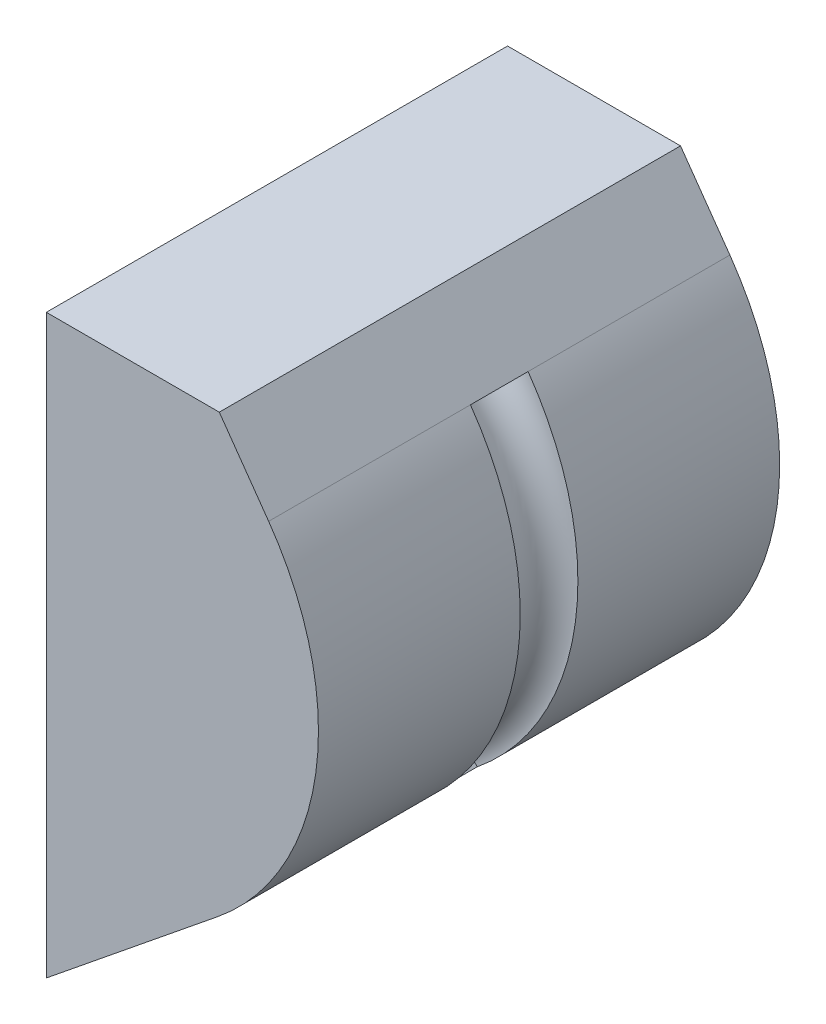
ISO-10303-21;
HEADER;
FILE_DESCRIPTION(('STEP AP214'),'2;1');
FILE_NAME('part.step','',(''),(''),'','','');
FILE_SCHEMA(('AUTOMOTIVE_DESIGN { 1 0 10303 214 1 1 1 1 }'));
ENDSEC;
DATA;
#1=APPLICATION_CONTEXT('core data for automotive mechanical design processes');
#2=APPLICATION_PROTOCOL_DEFINITION('international standard','automotive_design',2000,#1);
#3=PRODUCT_CONTEXT('',#1,'mechanical');
#4=PRODUCT('Part','Part','',(#3));
#5=PRODUCT_RELATED_PRODUCT_CATEGORY('part','',(#4));
#6=PRODUCT_DEFINITION_FORMATION('','',#4);
#7=PRODUCT_DEFINITION_CONTEXT('part definition',#1,'design');
#8=PRODUCT_DEFINITION('design','',#6,#7);
#9=PRODUCT_DEFINITION_SHAPE('','',#8);
#10=(LENGTH_UNIT() NAMED_UNIT(*) SI_UNIT(.MILLI.,.METRE.));
#11=(NAMED_UNIT(*) PLANE_ANGLE_UNIT() SI_UNIT($,.RADIAN.));
#12=(NAMED_UNIT(*) SI_UNIT($,.STERADIAN.) SOLID_ANGLE_UNIT());
#13=UNCERTAINTY_MEASURE_WITH_UNIT(LENGTH_MEASURE(1.E-05),#10,'distance_accuracy_value','');
#14=(GEOMETRIC_REPRESENTATION_CONTEXT(3) GLOBAL_UNCERTAINTY_ASSIGNED_CONTEXT((#13)) GLOBAL_UNIT_ASSIGNED_CONTEXT((#10,
#11,#12)) REPRESENTATION_CONTEXT('',''));
#15=CARTESIAN_POINT('',(0.,0.,0.));
#16=DIRECTION('',(0.,0.,1.));
#17=DIRECTION('',(1.,0.,0.));
#18=AXIS2_PLACEMENT_3D('',#15,#16,#17);
#19=CARTESIAN_POINT('',(0.0911484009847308,-39.3044537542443,40.));
#20=DIRECTION('',(0.,0.,-1.));
#21=DIRECTION('',(-1.,0.,0.));
#22=AXIS2_PLACEMENT_3D('',#19,#20,#21);
#23=CYLINDRICAL_SURFACE('',#22,47.1085503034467);
#24=DIRECTION('',(0.,0.,-1.));
#25=VECTOR('',#24,1.);
#26=CARTESIAN_POINT('',(29.7407595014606,-75.9120495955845,40.));
#27=LINE('',#26,#25);
#28=CARTESIAN_POINT('',(29.7407595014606,-75.9120495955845,40.));
#29=VERTEX_POINT('',#28);
#30=CARTESIAN_POINT('',(29.7407595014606,-75.9120495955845,5.));
#31=VERTEX_POINT('',#30);
#32=EDGE_CURVE('E41',#29,#31,#27,.T.);
#33=ORIENTED_EDGE('',*,*,#32,.T.);
#34=CARTESIAN_POINT('',(0.0911484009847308,-39.3044537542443,5.));
#35=DIRECTION('',(0.,0.,-1.));
#36=DIRECTION('',(-1.,0.,0.));
#37=AXIS2_PLACEMENT_3D('',#34,#35,#36);
#38=CIRCLE('',#37,47.1085503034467);
#39=CARTESIAN_POINT('',(38.5631158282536,-12.1176327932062,5.));
#40=VERTEX_POINT('',#39);
#41=EDGE_CURVE('E102',#31,#40,#38,.F.);
#42=ORIENTED_EDGE('',*,*,#41,.T.);
#43=DIRECTION('',(0.,0.,-1.));
#44=VECTOR('',#43,1.);
#45=CARTESIAN_POINT('',(38.5631158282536,-12.1176327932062,40.));
#46=LINE('',#45,#44);
#47=CARTESIAN_POINT('',(38.5631158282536,-12.1176327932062,40.));
#48=VERTEX_POINT('',#47);
#49=EDGE_CURVE('E95',#48,#40,#46,.T.);
#50=ORIENTED_EDGE('',*,*,#49,.F.);
#51=CARTESIAN_POINT('',(0.0911484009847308,-39.3044537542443,40.));
#52=DIRECTION('',(0.,0.,1.));
#53=DIRECTION('',(-1.,0.,0.));
#54=AXIS2_PLACEMENT_3D('',#51,#52,#53);
#55=CIRCLE('',#54,47.1085503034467);
#56=EDGE_CURVE('E134',#29,#48,#55,.T.);
#57=ORIENTED_EDGE('',*,*,#56,.F.);
#58=EDGE_LOOP('',(#33,#42,#50,#57));
#59=FACE_BOUND('',#58,.T.);
#60=ADVANCED_FACE('F33',(#59),#23,.T.);
#61=CARTESIAN_POINT('',(0.,0.,40.));
#62=DIRECTION('',(1.,0.,0.));
#63=DIRECTION('',(0.,1.,0.));
#64=AXIS2_PLACEMENT_3D('',#61,#62,#63);
#65=PLANE('',#64);
#66=DIRECTION('',(0.,-1.,0.));
#67=VECTOR('',#66,1.);
#68=CARTESIAN_POINT('',(0.,0.,-40.));
#69=LINE('',#68,#67);
#70=CARTESIAN_POINT('',(0.,0.,-40.));
#71=VERTEX_POINT('',#70);
#72=CARTESIAN_POINT('',(0.,-100.,-40.));
#73=VERTEX_POINT('',#72);
#74=EDGE_CURVE('E115',#71,#73,#69,.T.);
#75=ORIENTED_EDGE('',*,*,#74,.T.);
#76=DIRECTION('',(0.,0.,-1.));
#77=VECTOR('',#76,1.);
#78=CARTESIAN_POINT('',(0.,-100.,40.));
#79=LINE('',#78,#77);
#80=CARTESIAN_POINT('',(0.,-100.,40.));
#81=VERTEX_POINT('',#80);
#82=EDGE_CURVE('E11',#81,#73,#79,.T.);
#83=ORIENTED_EDGE('',*,*,#82,.F.);
#84=DIRECTION('',(0.,-1.,0.));
#85=VECTOR('',#84,1.);
#86=CARTESIAN_POINT('',(0.,0.,40.));
#87=LINE('',#86,#85);
#88=CARTESIAN_POINT('',(0.,0.,40.));
#89=VERTEX_POINT('',#88);
#90=EDGE_CURVE('E138',#89,#81,#87,.T.);
#91=ORIENTED_EDGE('',*,*,#90,.F.);
#92=DIRECTION('',(0.,0.,-1.));
#93=VECTOR('',#92,1.);
#94=CARTESIAN_POINT('',(0.,0.,40.));
#95=LINE('',#94,#93);
#96=EDGE_CURVE('E126',#89,#71,#95,.T.);
#97=ORIENTED_EDGE('',*,*,#96,.T.);
#98=EDGE_LOOP('',(#75,#83,#91,#97));
#99=FACE_BOUND('',#98,.T.);
#100=ADVANCED_FACE('F35',(#99),#65,.F.);
#101=CARTESIAN_POINT('',(29.7407595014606,-75.9120495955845,40.));
#102=DIRECTION('',(-0.629389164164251,0.777090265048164,0.));
#103=DIRECTION('',(-0.777090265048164,-0.629389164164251,0.));
#104=AXIS2_PLACEMENT_3D('',#101,#102,#103);
#105=PLANE('',#104);
#106=DIRECTION('',(0.777090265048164,0.62938916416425,0.));
#107=VECTOR('',#106,1.);
#108=CARTESIAN_POINT('',(29.7407595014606,-75.9120495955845,-40.));
#109=LINE('',#108,#107);
#110=CARTESIAN_POINT('',(29.7407595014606,-75.9120495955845,-40.));
#111=VERTEX_POINT('',#110);
#112=EDGE_CURVE('E146',#73,#111,#109,.T.);
#113=ORIENTED_EDGE('',*,*,#112,.T.);
#114=CARTESIAN_POINT('',(29.7407595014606,-75.9120495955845,-5.));
#115=VERTEX_POINT('',#114);
#116=EDGE_CURVE('E120',#115,#111,#27,.T.);
#117=ORIENTED_EDGE('',*,*,#116,.F.);
#118=EDGE_CURVE('E121',#31,#115,#27,.T.);
#119=ORIENTED_EDGE('',*,*,#118,.F.);
#120=ORIENTED_EDGE('',*,*,#32,.F.);
#121=DIRECTION('',(0.777090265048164,0.62938916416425,0.));
#122=VECTOR('',#121,1.);
#123=CARTESIAN_POINT('',(29.7407595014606,-75.9120495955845,40.));
#124=LINE('',#123,#122);
#125=EDGE_CURVE('E136',#81,#29,#124,.T.);
#126=ORIENTED_EDGE('',*,*,#125,.F.);
#127=ORIENTED_EDGE('',*,*,#82,.T.);
#128=EDGE_LOOP('',(#113,#117,#119,#120,#126,#127));
#129=FACE_BOUND('',#128,.T.);
#130=ADVANCED_FACE('F157',(#129),#105,.F.);
#131=CARTESIAN_POINT('',(38.5631158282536,-12.1176327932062,-5.));
#132=VERTEX_POINT('',#131);
#133=CARTESIAN_POINT('',(38.5631158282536,-12.1176327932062,-40.));
#134=VERTEX_POINT('',#133);
#135=EDGE_CURVE('E96',#132,#134,#46,.T.);
#136=ORIENTED_EDGE('',*,*,#135,.F.);
#137=CARTESIAN_POINT('',(0.0911484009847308,-39.3044537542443,-5.));
#138=DIRECTION('',(0.,0.,1.));
#139=DIRECTION('',(1.,0.,0.));
#140=AXIS2_PLACEMENT_3D('',#137,#138,#139);
#141=CIRCLE('',#140,47.1085503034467);
#142=EDGE_CURVE('E105',#132,#115,#141,.F.);
#143=ORIENTED_EDGE('',*,*,#142,.T.);
#144=ORIENTED_EDGE('',*,*,#116,.T.);
#145=CARTESIAN_POINT('',(0.0911484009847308,-39.3044537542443,-40.));
#146=DIRECTION('',(0.,0.,1.));
#147=DIRECTION('',(-1.,0.,0.));
#148=AXIS2_PLACEMENT_3D('',#145,#146,#147);
#149=CIRCLE('',#148,47.1085503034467);
#150=EDGE_CURVE('E144',#111,#134,#149,.T.);
#151=ORIENTED_EDGE('',*,*,#150,.T.);
#152=EDGE_LOOP('',(#136,#143,#144,#151));
#153=FACE_BOUND('',#152,.T.);
#154=ADVANCED_FACE('F160',(#153),#23,.T.);
#155=CARTESIAN_POINT('',(30.,0.,40.));
#156=DIRECTION('',(-0.81666634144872,-0.57711011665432,0.));
#157=DIRECTION('',(0.577110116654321,-0.81666634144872,0.));
#158=AXIS2_PLACEMENT_3D('',#155,#156,#157);
#159=PLANE('',#158);
#160=DIRECTION('',(-0.57711011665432,0.81666634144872,0.));
#161=VECTOR('',#160,1.);
#162=CARTESIAN_POINT('',(30.,0.,-40.));
#163=LINE('',#162,#161);
#164=CARTESIAN_POINT('',(30.,0.,-40.));
#165=VERTEX_POINT('',#164);
#166=EDGE_CURVE('E142',#134,#165,#163,.T.);
#167=ORIENTED_EDGE('',*,*,#166,.T.);
#168=DIRECTION('',(0.,0.,-1.));
#169=VECTOR('',#168,1.);
#170=CARTESIAN_POINT('',(30.,0.,40.));
#171=LINE('',#170,#169);
#172=CARTESIAN_POINT('',(30.,0.,40.));
#173=VERTEX_POINT('',#172);
#174=EDGE_CURVE('E123',#173,#165,#171,.T.);
#175=ORIENTED_EDGE('',*,*,#174,.F.);
#176=DIRECTION('',(-0.57711011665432,0.81666634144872,0.));
#177=VECTOR('',#176,1.);
#178=CARTESIAN_POINT('',(30.,0.,40.));
#179=LINE('',#178,#177);
#180=EDGE_CURVE('E119',#48,#173,#179,.T.);
#181=ORIENTED_EDGE('',*,*,#180,.F.);
#182=ORIENTED_EDGE('',*,*,#49,.T.);
#183=EDGE_CURVE('E91',#40,#132,#46,.T.);
#184=ORIENTED_EDGE('',*,*,#183,.T.);
#185=ORIENTED_EDGE('',*,*,#135,.T.);
#186=EDGE_LOOP('',(#167,#175,#181,#182,#184,#185));
#187=FACE_BOUND('',#186,.T.);
#188=ADVANCED_FACE('F117',(#187),#159,.F.);
#189=CARTESIAN_POINT('',(0.,0.,40.));
#190=DIRECTION('',(0.,-1.,0.));
#191=DIRECTION('',(0.,0.,-1.));
#192=AXIS2_PLACEMENT_3D('',#189,#190,#191);
#193=PLANE('',#192);
#194=DIRECTION('',(-1.,0.,0.));
#195=VECTOR('',#194,1.);
#196=CARTESIAN_POINT('',(0.,0.,-40.));
#197=LINE('',#196,#195);
#198=EDGE_CURVE('E140',#165,#71,#197,.T.);
#199=ORIENTED_EDGE('',*,*,#198,.T.);
#200=ORIENTED_EDGE('',*,*,#96,.F.);
#201=DIRECTION('',(-1.,0.,0.));
#202=VECTOR('',#201,1.);
#203=CARTESIAN_POINT('',(0.,0.,40.));
#204=LINE('',#203,#202);
#205=EDGE_CURVE('E55',#173,#89,#204,.T.);
#206=ORIENTED_EDGE('',*,*,#205,.F.);
#207=ORIENTED_EDGE('',*,*,#174,.T.);
#208=EDGE_LOOP('',(#199,#200,#206,#207));
#209=FACE_BOUND('',#208,.T.);
#210=ADVANCED_FACE('F165',(#209),#193,.F.);
#211=CARTESIAN_POINT('',(0.0911484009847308,-39.3044537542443,40.));
#212=DIRECTION('',(0.,0.,-1.));
#213=DIRECTION('',(-1.,0.,0.));
#214=AXIS2_PLACEMENT_3D('',#211,#212,#213);
#215=PLANE('',#214);
#216=ORIENTED_EDGE('',*,*,#90,.T.);
#217=ORIENTED_EDGE('',*,*,#125,.T.);
#218=ORIENTED_EDGE('',*,*,#56,.T.);
#219=ORIENTED_EDGE('',*,*,#180,.T.);
#220=ORIENTED_EDGE('',*,*,#205,.T.);
#221=EDGE_LOOP('',(#216,#217,#218,#219,#220));
#222=FACE_BOUND('',#221,.T.);
#223=ADVANCED_FACE('F169',(#222),#215,.F.);
#224=CARTESIAN_POINT('',(0.0911484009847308,-39.3044537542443,-40.));
#225=DIRECTION('',(0.,0.,-1.));
#226=DIRECTION('',(-1.,0.,0.));
#227=AXIS2_PLACEMENT_3D('',#224,#225,#226);
#228=PLANE('',#227);
#229=ORIENTED_EDGE('',*,*,#74,.F.);
#230=ORIENTED_EDGE('',*,*,#198,.F.);
#231=ORIENTED_EDGE('',*,*,#166,.F.);
#232=ORIENTED_EDGE('',*,*,#150,.F.);
#233=ORIENTED_EDGE('',*,*,#112,.F.);
#234=EDGE_LOOP('',(#229,#230,#231,#232,#233));
#235=FACE_BOUND('',#234,.T.);
#236=ADVANCED_FACE('F164',(#235),#228,.T.);
#237=CARTESIAN_POINT('',(29.7407595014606,-75.9120495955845,0.));
#238=DIRECTION('',(0.777090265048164,0.629389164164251,0.));
#239=DIRECTION('',(-0.629389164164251,0.777090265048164,0.));
#240=AXIS2_PLACEMENT_3D('',#237,#238,#239);
#241=PLANE('',#240);
#242=ORIENTED_EDGE('',*,*,#118,.T.);
#243=CARTESIAN_POINT('',(29.7407595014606,-75.9120495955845,0.));
#244=DIRECTION('',(0.777090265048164,0.629389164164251,0.));
#245=DIRECTION('',(-0.629389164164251,0.777090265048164,0.));
#246=AXIS2_PLACEMENT_3D('',#243,#244,#245);
#247=CIRCLE('',#246,5.);
#248=EDGE_CURVE('E107',#115,#31,#247,.T.);
#249=ORIENTED_EDGE('',*,*,#248,.T.);
#250=EDGE_LOOP('',(#242,#249));
#251=FACE_BOUND('',#250,.T.);
#252=ADVANCED_FACE('F154',(#251),#241,.T.);
#253=CARTESIAN_POINT('',(0.0911484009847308,-39.3044537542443,0.));
#254=DIRECTION('',(0.,0.,1.));
#255=DIRECTION('',(1.,0.,0.));
#256=AXIS2_PLACEMENT_3D('',#253,#254,#255);
#257=TOROIDAL_SURFACE('',#256,47.1085503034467,5.);
#258=ORIENTED_EDGE('',*,*,#248,.F.);
#259=ORIENTED_EDGE('',*,*,#142,.F.);
#260=CARTESIAN_POINT('',(38.5631158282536,-12.1176327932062,0.));
#261=DIRECTION('',(-0.57711011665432,0.81666634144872,0.));
#262=DIRECTION('',(-0.81666634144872,-0.57711011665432,0.));
#263=AXIS2_PLACEMENT_3D('',#260,#261,#262);
#264=CIRCLE('',#263,5.);
#265=EDGE_CURVE('E47',#132,#40,#264,.T.);
#266=ORIENTED_EDGE('',*,*,#265,.T.);
#267=ORIENTED_EDGE('',*,*,#41,.F.);
#268=EDGE_LOOP('',(#258,#259,#266,#267));
#269=FACE_BOUND('',#268,.T.);
#270=ADVANCED_FACE('F101',(#269),#257,.F.);
#271=CARTESIAN_POINT('',(38.5631158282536,-12.1176327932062,0.));
#272=DIRECTION('',(-0.57711011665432,0.81666634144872,0.));
#273=DIRECTION('',(-0.81666634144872,-0.57711011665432,0.));
#274=AXIS2_PLACEMENT_3D('',#271,#272,#273);
#275=PLANE('',#274);
#276=ORIENTED_EDGE('',*,*,#265,.F.);
#277=ORIENTED_EDGE('',*,*,#183,.F.);
#278=EDGE_LOOP('',(#276,#277));
#279=FACE_BOUND('',#278,.T.);
#280=ADVANCED_FACE('F92',(#279),#275,.F.);
#281=CLOSED_SHELL('',(#60,#100,#130,#154,#188,#210,#223,#236,#252,#270,#280));
#282=MANIFOLD_SOLID_BREP('B2',#281);
#283=ADVANCED_BREP_SHAPE_REPRESENTATION('',(#18,#282),#14);
#284=SHAPE_DEFINITION_REPRESENTATION(#9,#283);
ENDSEC;
END-ISO-10303-21;
